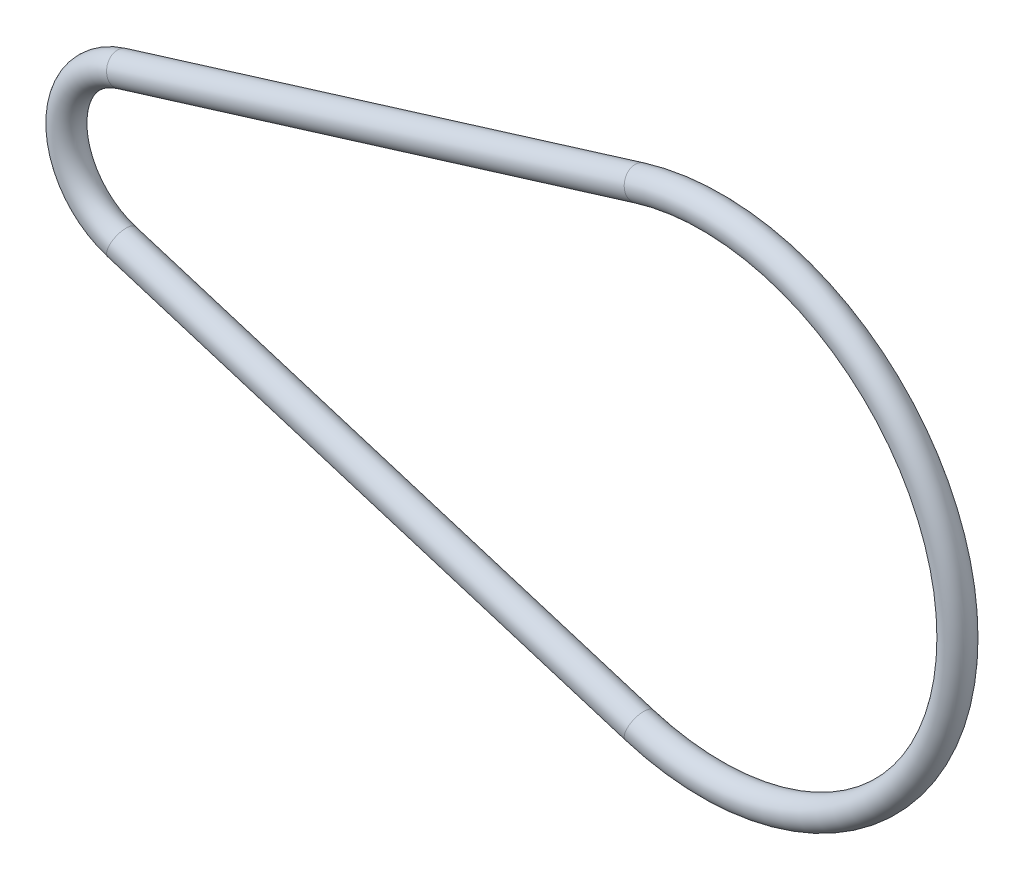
from build123d import *

# Parameters (mm, degrees)
ESQUISSE2_R = 1


with BuildPart() as part:
    # Balayage1: sweep along a path in Esquisse1
    with BuildLine(Plane.XY) as balayage1_path:
        Line((-1.592307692, 5.159898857), (34.016666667, 16.148572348))
        ThreePointArc((34.016666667, 16.148572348), (55.9, 0), (34.016666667, -16.148572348))
        Line((34.016666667, -16.148572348), (-1.592307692, -5.159898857))
        ThreePointArc((-1.592307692, -5.159898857), (-5.4, 0), (-1.592307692, 5.159898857))
    # Esquisse2 → Balayage1 (sweep)
    with BuildSketch(Plane(origin=(0, 0, 0), x_dir=(1, 0, 0), z_dir=(0, 1, 0))):
        with Locations((55.9, 0)):
            Circle(ESQUISSE2_R)
    sweep(path=balayage1_path.line)


solid = part.part
